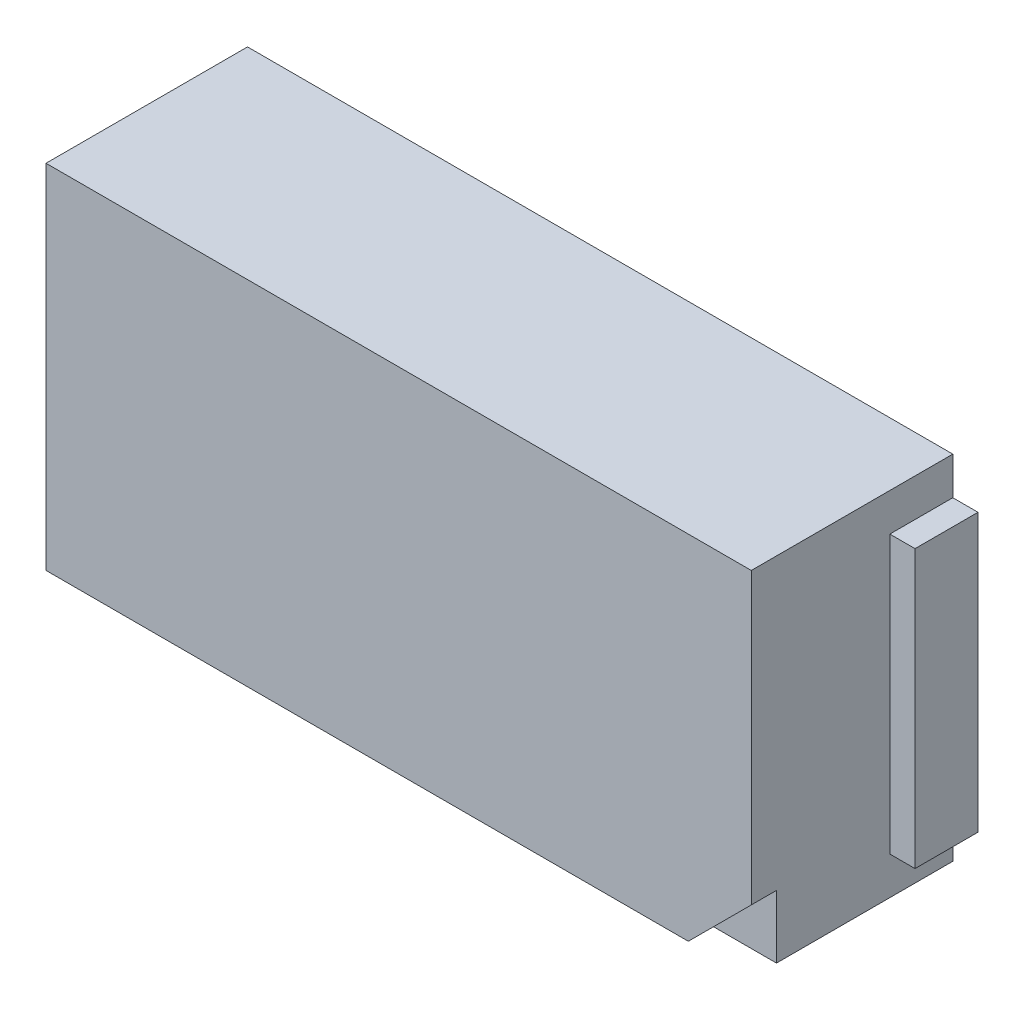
ISO-10303-21;
HEADER;
FILE_DESCRIPTION(('STEP AP214'),'2;1');
FILE_NAME('part.step','',(''),(''),'','','');
FILE_SCHEMA(('AUTOMOTIVE_DESIGN { 1 0 10303 214 1 1 1 1 }'));
ENDSEC;
DATA;
#1=APPLICATION_CONTEXT('core data for automotive mechanical design processes');
#2=APPLICATION_PROTOCOL_DEFINITION('international standard','automotive_design',2000,#1);
#3=PRODUCT_CONTEXT('',#1,'mechanical');
#4=PRODUCT('Part','Part','',(#3));
#5=PRODUCT_RELATED_PRODUCT_CATEGORY('part','',(#4));
#6=PRODUCT_DEFINITION_FORMATION('','',#4);
#7=PRODUCT_DEFINITION_CONTEXT('part definition',#1,'design');
#8=PRODUCT_DEFINITION('design','',#6,#7);
#9=PRODUCT_DEFINITION_SHAPE('','',#8);
#10=(LENGTH_UNIT() NAMED_UNIT(*) SI_UNIT(.MILLI.,.METRE.));
#11=(NAMED_UNIT(*) PLANE_ANGLE_UNIT() SI_UNIT($,.RADIAN.));
#12=(NAMED_UNIT(*) SI_UNIT($,.STERADIAN.) SOLID_ANGLE_UNIT());
#13=UNCERTAINTY_MEASURE_WITH_UNIT(LENGTH_MEASURE(1.E-05),#10,'distance_accuracy_value','');
#14=(GEOMETRIC_REPRESENTATION_CONTEXT(3) GLOBAL_UNCERTAINTY_ASSIGNED_CONTEXT((#13)) GLOBAL_UNIT_ASSIGNED_CONTEXT((#10,
#11,#12)) REPRESENTATION_CONTEXT('',''));
#15=CARTESIAN_POINT('',(0.,0.,0.));
#16=DIRECTION('',(0.,0.,1.));
#17=DIRECTION('',(1.,0.,0.));
#18=AXIS2_PLACEMENT_3D('',#15,#16,#17);
#19=CARTESIAN_POINT('',(3.,1.25,0.));
#20=DIRECTION('',(-1.,0.,0.));
#21=DIRECTION('',(0.,-1.,0.));
#22=AXIS2_PLACEMENT_3D('',#19,#20,#21);
#23=PLANE('',#22);
#24=DIRECTION('',(0.,-1.,0.));
#25=VECTOR('',#24,1.);
#26=CARTESIAN_POINT('',(3.,0.7,0.25));
#27=LINE('',#26,#25);
#28=CARTESIAN_POINT('',(3.,1.25,0.25));
#29=VERTEX_POINT('',#28);
#30=CARTESIAN_POINT('',(3.,0.15,0.25));
#31=VERTEX_POINT('',#30);
#32=EDGE_CURVE('E202',#29,#31,#27,.T.);
#33=ORIENTED_EDGE('',*,*,#32,.T.);
#34=DIRECTION('',(0.,0.,-1.));
#35=VECTOR('',#34,1.);
#36=CARTESIAN_POINT('',(3.,0.15,0.125));
#37=LINE('',#36,#35);
#38=CARTESIAN_POINT('',(3.,0.14999999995,0.));
#39=VERTEX_POINT('',#38);
#40=EDGE_CURVE('E205',#31,#39,#37,.T.);
#41=ORIENTED_EDGE('',*,*,#40,.T.);
#42=DIRECTION('',(0.,-1.,0.));
#43=VECTOR('',#42,1.);
#44=CARTESIAN_POINT('',(3.,0.7,0.));
#45=LINE('',#44,#43);
#46=CARTESIAN_POINT('',(3.,1.25000000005,0.));
#47=VERTEX_POINT('',#46);
#48=EDGE_CURVE('E294',#47,#39,#45,.T.);
#49=ORIENTED_EDGE('',*,*,#48,.F.);
#50=DIRECTION('',(0.,0.,1.));
#51=VECTOR('',#50,1.);
#52=CARTESIAN_POINT('',(3.,1.25,0.125));
#53=LINE('',#52,#51);
#54=EDGE_CURVE('E207',#47,#29,#53,.T.);
#55=ORIENTED_EDGE('',*,*,#54,.T.);
#56=EDGE_LOOP('',(#33,#41,#49,#55));
#57=FACE_BOUND('',#56,.T.);
#58=ADVANCED_FACE('F16',(#57),#23,.F.);
#59=CARTESIAN_POINT('',(0.,0.15,0.25));
#60=DIRECTION('',(1.,0.,0.));
#61=DIRECTION('',(0.,0.,-1.));
#62=AXIS2_PLACEMENT_3D('',#59,#60,#61);
#63=PLANE('',#62);
#64=DIRECTION('',(0.,1.,0.));
#65=VECTOR('',#64,1.);
#66=CARTESIAN_POINT('',(0.,0.7,0.25));
#67=LINE('',#66,#65);
#68=CARTESIAN_POINT('',(0.,0.15,0.25));
#69=VERTEX_POINT('',#68);
#70=CARTESIAN_POINT('',(0.,1.25,0.25));
#71=VERTEX_POINT('',#70);
#72=EDGE_CURVE('E235',#69,#71,#67,.T.);
#73=ORIENTED_EDGE('',*,*,#72,.T.);
#74=DIRECTION('',(0.,0.,-1.));
#75=VECTOR('',#74,1.);
#76=CARTESIAN_POINT('',(0.,1.25,0.125));
#77=LINE('',#76,#75);
#78=CARTESIAN_POINT('',(0.,1.25000000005,0.));
#79=VERTEX_POINT('',#78);
#80=EDGE_CURVE('E226',#71,#79,#77,.T.);
#81=ORIENTED_EDGE('',*,*,#80,.T.);
#82=DIRECTION('',(0.,1.,0.));
#83=VECTOR('',#82,1.);
#84=CARTESIAN_POINT('',(0.,0.7,0.));
#85=LINE('',#84,#83);
#86=CARTESIAN_POINT('',(0.,0.14999999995,0.));
#87=VERTEX_POINT('',#86);
#88=EDGE_CURVE('E288',#87,#79,#85,.T.);
#89=ORIENTED_EDGE('',*,*,#88,.F.);
#90=DIRECTION('',(0.,0.,1.));
#91=VECTOR('',#90,1.);
#92=CARTESIAN_POINT('',(0.,0.15,0.125));
#93=LINE('',#92,#91);
#94=EDGE_CURVE('E237',#87,#69,#93,.T.);
#95=ORIENTED_EDGE('',*,*,#94,.T.);
#96=EDGE_LOOP('',(#73,#81,#89,#95));
#97=FACE_BOUND('',#96,.T.);
#98=ADVANCED_FACE('F191',(#97),#63,.F.);
#99=CARTESIAN_POINT('',(0.1,0.15,0.));
#100=DIRECTION('',(0.,1.,0.));
#101=DIRECTION('',(-1.,0.,0.));
#102=AXIS2_PLACEMENT_3D('',#99,#100,#101);
#103=PLANE('',#102);
#104=DIRECTION('',(-1.,0.,0.));
#105=VECTOR('',#104,1.);
#106=CARTESIAN_POINT('',(0.05,0.15,0.25));
#107=LINE('',#106,#105);
#108=CARTESIAN_POINT('',(0.1,0.14999999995,0.25));
#109=VERTEX_POINT('',#108);
#110=EDGE_CURVE('E232',#109,#69,#107,.T.);
#111=ORIENTED_EDGE('',*,*,#110,.T.);
#112=ORIENTED_EDGE('',*,*,#94,.F.);
#113=DIRECTION('',(-1.,0.,0.));
#114=VECTOR('',#113,1.);
#115=CARTESIAN_POINT('',(1.5,0.1499999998,0.));
#116=LINE('',#115,#114);
#117=CARTESIAN_POINT('',(0.0999999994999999,0.14999999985,0.));
#118=VERTEX_POINT('',#117);
#119=EDGE_CURVE('E290',#118,#87,#116,.T.);
#120=ORIENTED_EDGE('',*,*,#119,.F.);
#121=DIRECTION('',(0.,0.,1.));
#122=VECTOR('',#121,1.);
#123=CARTESIAN_POINT('',(0.1,0.1499999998,0.4));
#124=LINE('',#123,#122);
#125=EDGE_CURVE('E280',#118,#109,#124,.T.);
#126=ORIENTED_EDGE('',*,*,#125,.T.);
#127=EDGE_LOOP('',(#111,#112,#120,#126));
#128=FACE_BOUND('',#127,.T.);
#129=ADVANCED_FACE('F187',(#128),#103,.F.);
#130=CARTESIAN_POINT('',(0.1,0.15,0.25));
#131=DIRECTION('',(0.,0.,-1.));
#132=DIRECTION('',(-1.,0.,0.));
#133=AXIS2_PLACEMENT_3D('',#130,#131,#132);
#134=PLANE('',#133);
#135=DIRECTION('',(0.,1.,0.));
#136=VECTOR('',#135,1.);
#137=CARTESIAN_POINT('',(0.1,0.7,0.25));
#138=LINE('',#137,#136);
#139=CARTESIAN_POINT('',(0.1,1.25000000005,0.25));
#140=VERTEX_POINT('',#139);
#141=EDGE_CURVE('E277',#109,#140,#138,.T.);
#142=ORIENTED_EDGE('',*,*,#141,.T.);
#143=DIRECTION('',(-1.,0.,0.));
#144=VECTOR('',#143,1.);
#145=CARTESIAN_POINT('',(0.05,1.25,0.25));
#146=LINE('',#145,#144);
#147=EDGE_CURVE('E229',#140,#71,#146,.T.);
#148=ORIENTED_EDGE('',*,*,#147,.T.);
#149=ORIENTED_EDGE('',*,*,#72,.F.);
#150=ORIENTED_EDGE('',*,*,#110,.F.);
#151=EDGE_LOOP('',(#142,#148,#149,#150));
#152=FACE_BOUND('',#151,.T.);
#153=ADVANCED_FACE('F183',(#152),#134,.F.);
#154=CARTESIAN_POINT('',(0.,1.25,0.));
#155=DIRECTION('',(0.,-1.,0.));
#156=DIRECTION('',(1.,0.,0.));
#157=AXIS2_PLACEMENT_3D('',#154,#155,#156);
#158=PLANE('',#157);
#159=ORIENTED_EDGE('',*,*,#147,.F.);
#160=DIRECTION('',(0.,0.,-1.));
#161=VECTOR('',#160,1.);
#162=CARTESIAN_POINT('',(0.1,1.2500000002,0.4));
#163=LINE('',#162,#161);
#164=CARTESIAN_POINT('',(0.0999999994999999,1.25000000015,0.));
#165=VERTEX_POINT('',#164);
#166=EDGE_CURVE('E274',#140,#165,#163,.T.);
#167=ORIENTED_EDGE('',*,*,#166,.T.);
#168=DIRECTION('',(1.,0.,0.));
#169=VECTOR('',#168,1.);
#170=CARTESIAN_POINT('',(1.5,1.2500000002,0.));
#171=LINE('',#170,#169);
#172=EDGE_CURVE('E286',#79,#165,#171,.T.);
#173=ORIENTED_EDGE('',*,*,#172,.F.);
#174=ORIENTED_EDGE('',*,*,#80,.F.);
#175=EDGE_LOOP('',(#159,#167,#173,#174));
#176=FACE_BOUND('',#175,.T.);
#177=ADVANCED_FACE('F179',(#176),#158,.F.);
#178=CARTESIAN_POINT('',(2.9,1.25,0.25));
#179=DIRECTION('',(0.,-1.,0.));
#180=DIRECTION('',(0.,0.,-1.));
#181=AXIS2_PLACEMENT_3D('',#178,#179,#180);
#182=PLANE('',#181);
#183=DIRECTION('',(1.,0.,0.));
#184=VECTOR('',#183,1.);
#185=CARTESIAN_POINT('',(2.95,1.25,0.25));
#186=LINE('',#185,#184);
#187=CARTESIAN_POINT('',(2.9,1.25000000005,0.25));
#188=VERTEX_POINT('',#187);
#189=EDGE_CURVE('E211',#188,#29,#186,.T.);
#190=ORIENTED_EDGE('',*,*,#189,.T.);
#191=ORIENTED_EDGE('',*,*,#54,.F.);
#192=DIRECTION('',(1.,0.,0.));
#193=VECTOR('',#192,1.);
#194=CARTESIAN_POINT('',(1.5,1.2500000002,0.));
#195=LINE('',#194,#193);
#196=CARTESIAN_POINT('',(2.9000000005,1.25000000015,0.));
#197=VERTEX_POINT('',#196);
#198=EDGE_CURVE('E216',#197,#47,#195,.T.);
#199=ORIENTED_EDGE('',*,*,#198,.F.);
#200=DIRECTION('',(0.,0.,1.));
#201=VECTOR('',#200,1.);
#202=CARTESIAN_POINT('',(2.9,1.2500000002,0.4));
#203=LINE('',#202,#201);
#204=EDGE_CURVE('E261',#197,#188,#203,.T.);
#205=ORIENTED_EDGE('',*,*,#204,.T.);
#206=EDGE_LOOP('',(#190,#191,#199,#205));
#207=FACE_BOUND('',#206,.T.);
#208=ADVANCED_FACE('F175',(#207),#182,.F.);
#209=CARTESIAN_POINT('',(3.,0.15,0.25));
#210=DIRECTION('',(0.,0.,-1.));
#211=DIRECTION('',(-1.,0.,0.));
#212=AXIS2_PLACEMENT_3D('',#209,#210,#211);
#213=PLANE('',#212);
#214=DIRECTION('',(1.,0.,0.));
#215=VECTOR('',#214,1.);
#216=CARTESIAN_POINT('',(2.95,0.15,0.25));
#217=LINE('',#216,#215);
#218=CARTESIAN_POINT('',(2.9,0.14999999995,0.25));
#219=VERTEX_POINT('',#218);
#220=EDGE_CURVE('E210',#219,#31,#217,.T.);
#221=ORIENTED_EDGE('',*,*,#220,.T.);
#222=ORIENTED_EDGE('',*,*,#32,.F.);
#223=ORIENTED_EDGE('',*,*,#189,.F.);
#224=DIRECTION('',(0.,-1.,0.));
#225=VECTOR('',#224,1.);
#226=CARTESIAN_POINT('',(2.9,0.7,0.25));
#227=LINE('',#226,#225);
#228=EDGE_CURVE('E220',#188,#219,#227,.T.);
#229=ORIENTED_EDGE('',*,*,#228,.T.);
#230=EDGE_LOOP('',(#221,#222,#223,#229));
#231=FACE_BOUND('',#230,.T.);
#232=ADVANCED_FACE('F171',(#231),#213,.F.);
#233=CARTESIAN_POINT('',(3.,0.15,0.));
#234=DIRECTION('',(0.,1.,0.));
#235=DIRECTION('',(-1.,0.,0.));
#236=AXIS2_PLACEMENT_3D('',#233,#234,#235);
#237=PLANE('',#236);
#238=ORIENTED_EDGE('',*,*,#220,.F.);
#239=DIRECTION('',(0.,0.,-1.));
#240=VECTOR('',#239,1.);
#241=CARTESIAN_POINT('',(2.9,0.1499999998,0.4));
#242=LINE('',#241,#240);
#243=CARTESIAN_POINT('',(2.90000000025,0.1499999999,0.));
#244=VERTEX_POINT('',#243);
#245=EDGE_CURVE('E258',#219,#244,#242,.T.);
#246=ORIENTED_EDGE('',*,*,#245,.T.);
#247=DIRECTION('',(-1.,0.,0.));
#248=VECTOR('',#247,1.);
#249=CARTESIAN_POINT('',(1.5,0.1499999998,0.));
#250=LINE('',#249,#248);
#251=EDGE_CURVE('E215',#39,#244,#250,.T.);
#252=ORIENTED_EDGE('',*,*,#251,.F.);
#253=ORIENTED_EDGE('',*,*,#40,.F.);
#254=EDGE_LOOP('',(#238,#246,#252,#253));
#255=FACE_BOUND('',#254,.T.);
#256=ADVANCED_FACE('F167',(#255),#237,.F.);
#257=CARTESIAN_POINT('',(3.,0.,0.));
#258=DIRECTION('',(0.,0.,-1.));
#259=DIRECTION('',(-1.,0.,0.));
#260=AXIS2_PLACEMENT_3D('',#257,#258,#259);
#261=PLANE('',#260);
#262=ORIENTED_EDGE('',*,*,#88,.T.);
#263=ORIENTED_EDGE('',*,*,#172,.T.);
#264=DIRECTION('',(0.,1.,0.));
#265=VECTOR('',#264,1.);
#266=CARTESIAN_POINT('',(0.1,0.7,0.));
#267=LINE('',#266,#265);
#268=CARTESIAN_POINT('',(0.09999999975,1.4,0.));
#269=VERTEX_POINT('',#268);
#270=EDGE_CURVE('E284',#165,#269,#267,.T.);
#271=ORIENTED_EDGE('',*,*,#270,.T.);
#272=DIRECTION('',(1.,0.,0.));
#273=VECTOR('',#272,1.);
#274=CARTESIAN_POINT('',(1.5,1.4,0.));
#275=LINE('',#274,#273);
#276=CARTESIAN_POINT('',(2.90000000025,1.4,0.));
#277=VERTEX_POINT('',#276);
#278=EDGE_CURVE('E270',#269,#277,#275,.T.);
#279=ORIENTED_EDGE('',*,*,#278,.T.);
#280=DIRECTION('',(0.,-1.,0.));
#281=VECTOR('',#280,1.);
#282=CARTESIAN_POINT('',(2.9,0.7,0.));
#283=LINE('',#282,#281);
#284=EDGE_CURVE('E264',#277,#197,#283,.T.);
#285=ORIENTED_EDGE('',*,*,#284,.T.);
#286=ORIENTED_EDGE('',*,*,#198,.T.);
#287=ORIENTED_EDGE('',*,*,#48,.T.);
#288=ORIENTED_EDGE('',*,*,#251,.T.);
#289=DIRECTION('',(0.,-1.,0.));
#290=VECTOR('',#289,1.);
#291=CARTESIAN_POINT('',(2.9,0.7,0.));
#292=LINE('',#291,#290);
#293=CARTESIAN_POINT('',(2.90000000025,0.,0.));
#294=VERTEX_POINT('',#293);
#295=EDGE_CURVE('E256',#244,#294,#292,.T.);
#296=ORIENTED_EDGE('',*,*,#295,.T.);
#297=DIRECTION('',(-1.,0.,0.));
#298=VECTOR('',#297,1.);
#299=CARTESIAN_POINT('',(1.5,0.,0.));
#300=LINE('',#299,#298);
#301=CARTESIAN_POINT('',(0.0999999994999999,0.,0.));
#302=VERTEX_POINT('',#301);
#303=EDGE_CURVE('E138',#294,#302,#300,.T.);
#304=ORIENTED_EDGE('',*,*,#303,.T.);
#305=DIRECTION('',(0.,1.,0.));
#306=VECTOR('',#305,1.);
#307=CARTESIAN_POINT('',(0.1,0.7,0.));
#308=LINE('',#307,#306);
#309=EDGE_CURVE('E135',#302,#118,#308,.T.);
#310=ORIENTED_EDGE('',*,*,#309,.T.);
#311=ORIENTED_EDGE('',*,*,#119,.T.);
#312=EDGE_LOOP('',(#262,#263,#271,#279,#285,#286,#287,#288,#296,#304,#310,#311));
#313=FACE_BOUND('',#312,.T.);
#314=ADVANCED_FACE('F163',(#313),#261,.T.);
#315=CARTESIAN_POINT('',(2.9,0.,0.7));
#316=DIRECTION('',(0.,0.,-1.));
#317=DIRECTION('',(-1.,0.,0.));
#318=AXIS2_PLACEMENT_3D('',#315,#316,#317);
#319=PLANE('',#318);
#320=DIRECTION('',(-0.707106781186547,-0.707106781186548,0.));
#321=VECTOR('',#320,1.);
#322=CARTESIAN_POINT('',(2.775,0.125,0.7));
#323=LINE('',#322,#321);
#324=CARTESIAN_POINT('',(2.9,0.250000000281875,0.7));
#325=VERTEX_POINT('',#324);
#326=CARTESIAN_POINT('',(2.65000000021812,0.,0.7));
#327=VERTEX_POINT('',#326);
#328=EDGE_CURVE('E241',#325,#327,#323,.T.);
#329=ORIENTED_EDGE('',*,*,#328,.T.);
#330=DIRECTION('',(1.,0.,0.));
#331=VECTOR('',#330,1.);
#332=CARTESIAN_POINT('',(1.5,0.,0.7));
#333=LINE('',#332,#331);
#334=CARTESIAN_POINT('',(2.9,0.,0.7));
#335=VERTEX_POINT('',#334);
#336=EDGE_CURVE('E127',#327,#335,#333,.T.);
#337=ORIENTED_EDGE('',*,*,#336,.T.);
#338=DIRECTION('',(0.,1.,0.));
#339=VECTOR('',#338,1.);
#340=CARTESIAN_POINT('',(2.9,0.7,0.7));
#341=LINE('',#340,#339);
#342=EDGE_CURVE('E242',#335,#325,#341,.T.);
#343=ORIENTED_EDGE('',*,*,#342,.T.);
#344=EDGE_LOOP('',(#329,#337,#343));
#345=FACE_BOUND('',#344,.T.);
#346=ADVANCED_FACE('F160',(#345),#319,.F.);
#347=CARTESIAN_POINT('',(0.1,0.,0.8));
#348=DIRECTION('',(1.,0.,0.));
#349=DIRECTION('',(0.,0.,-1.));
#350=AXIS2_PLACEMENT_3D('',#347,#348,#349);
#351=PLANE('',#350);
#352=ORIENTED_EDGE('',*,*,#141,.F.);
#353=ORIENTED_EDGE('',*,*,#125,.F.);
#354=ORIENTED_EDGE('',*,*,#309,.F.);
#355=DIRECTION('',(0.,0.,1.));
#356=VECTOR('',#355,1.);
#357=CARTESIAN_POINT('',(0.1,0.,0.4));
#358=LINE('',#357,#356);
#359=CARTESIAN_POINT('',(0.1,0.,0.8));
#360=VERTEX_POINT('',#359);
#361=EDGE_CURVE('E130',#302,#360,#358,.T.);
#362=ORIENTED_EDGE('',*,*,#361,.T.);
#363=DIRECTION('',(0.,1.,0.));
#364=VECTOR('',#363,1.);
#365=CARTESIAN_POINT('',(0.1,0.7,0.8));
#366=LINE('',#365,#364);
#367=CARTESIAN_POINT('',(0.1,1.4,0.8));
#368=VERTEX_POINT('',#367);
#369=EDGE_CURVE('E120',#360,#368,#366,.T.);
#370=ORIENTED_EDGE('',*,*,#369,.T.);
#371=DIRECTION('',(0.,0.,-1.));
#372=VECTOR('',#371,1.);
#373=CARTESIAN_POINT('',(0.1,1.4,0.4));
#374=LINE('',#373,#372);
#375=EDGE_CURVE('E272',#368,#269,#374,.T.);
#376=ORIENTED_EDGE('',*,*,#375,.T.);
#377=ORIENTED_EDGE('',*,*,#270,.F.);
#378=ORIENTED_EDGE('',*,*,#166,.F.);
#379=EDGE_LOOP('',(#352,#353,#354,#362,#370,#376,#377,#378));
#380=FACE_BOUND('',#379,.T.);
#381=ADVANCED_FACE('F132',(#380),#351,.F.);
#382=CARTESIAN_POINT('',(0.1,1.4,0.));
#383=DIRECTION('',(0.,-1.,0.));
#384=DIRECTION('',(1.,0.,0.));
#385=AXIS2_PLACEMENT_3D('',#382,#383,#384);
#386=PLANE('',#385);
#387=ORIENTED_EDGE('',*,*,#375,.F.);
#388=DIRECTION('',(1.,0.,0.));
#389=VECTOR('',#388,1.);
#390=CARTESIAN_POINT('',(1.5,1.4,0.8));
#391=LINE('',#390,#389);
#392=CARTESIAN_POINT('',(2.9,1.4,0.8));
#393=VERTEX_POINT('',#392);
#394=EDGE_CURVE('E124',#368,#393,#391,.T.);
#395=ORIENTED_EDGE('',*,*,#394,.T.);
#396=DIRECTION('',(0.,0.,-1.));
#397=VECTOR('',#396,1.);
#398=CARTESIAN_POINT('',(2.9,1.4,0.4));
#399=LINE('',#398,#397);
#400=EDGE_CURVE('E267',#393,#277,#399,.T.);
#401=ORIENTED_EDGE('',*,*,#400,.T.);
#402=ORIENTED_EDGE('',*,*,#278,.F.);
#403=EDGE_LOOP('',(#387,#395,#401,#402));
#404=FACE_BOUND('',#403,.T.);
#405=ADVANCED_FACE('F153',(#404),#386,.F.);
#406=CARTESIAN_POINT('',(2.9,0.,0.));
#407=DIRECTION('',(-1.,0.,0.));
#408=DIRECTION('',(0.,0.,1.));
#409=AXIS2_PLACEMENT_3D('',#406,#407,#408);
#410=PLANE('',#409);
#411=DIRECTION('',(0.,0.,-1.));
#412=VECTOR('',#411,1.);
#413=CARTESIAN_POINT('',(2.9,0.25,0.75));
#414=LINE('',#413,#412);
#415=CARTESIAN_POINT('',(2.9,0.25,0.8));
#416=VERTEX_POINT('',#415);
#417=EDGE_CURVE('E38',#416,#325,#414,.T.);
#418=ORIENTED_EDGE('',*,*,#417,.T.);
#419=ORIENTED_EDGE('',*,*,#342,.F.);
#420=DIRECTION('',(0.,0.,-1.));
#421=VECTOR('',#420,1.);
#422=CARTESIAN_POINT('',(2.9,0.,0.4));
#423=LINE('',#422,#421);
#424=EDGE_CURVE('E251',#335,#294,#423,.T.);
#425=ORIENTED_EDGE('',*,*,#424,.T.);
#426=ORIENTED_EDGE('',*,*,#295,.F.);
#427=ORIENTED_EDGE('',*,*,#245,.F.);
#428=ORIENTED_EDGE('',*,*,#228,.F.);
#429=ORIENTED_EDGE('',*,*,#204,.F.);
#430=ORIENTED_EDGE('',*,*,#284,.F.);
#431=ORIENTED_EDGE('',*,*,#400,.F.);
#432=DIRECTION('',(0.,-1.,0.));
#433=VECTOR('',#432,1.);
#434=CARTESIAN_POINT('',(2.9,0.7,0.8));
#435=LINE('',#434,#433);
#436=EDGE_CURVE('E243',#393,#416,#435,.T.);
#437=ORIENTED_EDGE('',*,*,#436,.T.);
#438=EDGE_LOOP('',(#418,#419,#425,#426,#427,#428,#429,#430,#431,#437));
#439=FACE_BOUND('',#438,.T.);
#440=ADVANCED_FACE('F148',(#439),#410,.F.);
#441=CARTESIAN_POINT('',(2.9,0.25,0.7));
#442=DIRECTION('',(-0.707106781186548,0.707106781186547,0.));
#443=DIRECTION('',(-0.707106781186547,-0.707106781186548,0.));
#444=AXIS2_PLACEMENT_3D('',#441,#442,#443);
#445=PLANE('',#444);
#446=DIRECTION('',(0.,0.,-1.));
#447=VECTOR('',#446,1.);
#448=CARTESIAN_POINT('',(2.6500000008,0.,0.4));
#449=LINE('',#448,#447);
#450=CARTESIAN_POINT('',(2.6500000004,0.,0.8));
#451=VERTEX_POINT('',#450);
#452=EDGE_CURVE('E30',#451,#327,#449,.T.);
#453=ORIENTED_EDGE('',*,*,#452,.T.);
#454=ORIENTED_EDGE('',*,*,#328,.F.);
#455=ORIENTED_EDGE('',*,*,#417,.F.);
#456=DIRECTION('',(-0.707106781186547,-0.707106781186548,0.));
#457=VECTOR('',#456,1.);
#458=CARTESIAN_POINT('',(2.9,0.25,0.8));
#459=LINE('',#458,#457);
#460=EDGE_CURVE('E20',#416,#451,#459,.T.);
#461=ORIENTED_EDGE('',*,*,#460,.T.);
#462=EDGE_LOOP('',(#453,#454,#455,#461));
#463=FACE_BOUND('',#462,.T.);
#464=ADVANCED_FACE('F142',(#463),#445,.F.);
#465=CARTESIAN_POINT('',(2.9,0.,0.));
#466=DIRECTION('',(0.,1.,0.));
#467=DIRECTION('',(-1.,0.,0.));
#468=AXIS2_PLACEMENT_3D('',#465,#466,#467);
#469=PLANE('',#468);
#470=ORIENTED_EDGE('',*,*,#452,.F.);
#471=DIRECTION('',(-1.,0.,0.));
#472=VECTOR('',#471,1.);
#473=CARTESIAN_POINT('',(1.5,0.,0.8));
#474=LINE('',#473,#472);
#475=EDGE_CURVE('E11',#451,#360,#474,.T.);
#476=ORIENTED_EDGE('',*,*,#475,.T.);
#477=ORIENTED_EDGE('',*,*,#361,.F.);
#478=ORIENTED_EDGE('',*,*,#303,.F.);
#479=ORIENTED_EDGE('',*,*,#424,.F.);
#480=ORIENTED_EDGE('',*,*,#336,.F.);
#481=EDGE_LOOP('',(#470,#476,#477,#478,#479,#480));
#482=FACE_BOUND('',#481,.T.);
#483=ADVANCED_FACE('F140',(#482),#469,.F.);
#484=CARTESIAN_POINT('',(2.9,0.,0.8));
#485=DIRECTION('',(0.,0.,-1.));
#486=DIRECTION('',(-1.,0.,0.));
#487=AXIS2_PLACEMENT_3D('',#484,#485,#486);
#488=PLANE('',#487);
#489=ORIENTED_EDGE('',*,*,#460,.F.);
#490=ORIENTED_EDGE('',*,*,#436,.F.);
#491=ORIENTED_EDGE('',*,*,#394,.F.);
#492=ORIENTED_EDGE('',*,*,#369,.F.);
#493=ORIENTED_EDGE('',*,*,#475,.F.);
#494=EDGE_LOOP('',(#489,#490,#491,#492,#493));
#495=FACE_BOUND('',#494,.T.);
#496=ADVANCED_FACE('F18',(#495),#488,.F.);
#497=CLOSED_SHELL('',(#58,#98,#129,#153,#177,#208,#232,#256,#314,#346,#381,#405,#440,#464,#483,#496));
#498=MANIFOLD_SOLID_BREP('B1',#497);
#499=ADVANCED_BREP_SHAPE_REPRESENTATION('',(#18,#498),#14);
#500=SHAPE_DEFINITION_REPRESENTATION(#9,#499);
ENDSEC;
END-ISO-10303-21;
